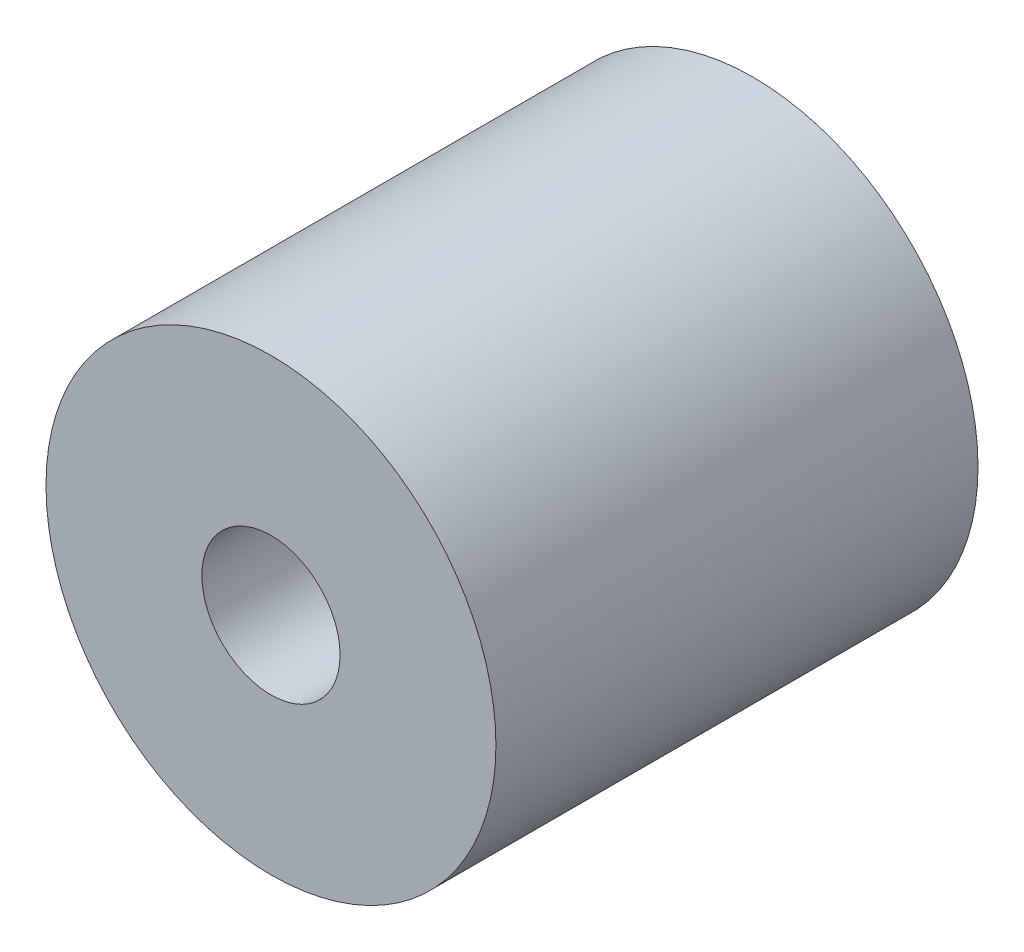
ISO-10303-21;
HEADER;
FILE_DESCRIPTION(('STEP AP214'),'2;1');
FILE_NAME('part.step','',(''),(''),'','','');
FILE_SCHEMA(('AUTOMOTIVE_DESIGN { 1 0 10303 214 1 1 1 1 }'));
ENDSEC;
DATA;
#1=APPLICATION_CONTEXT('core data for automotive mechanical design processes');
#2=APPLICATION_PROTOCOL_DEFINITION('international standard','automotive_design',2000,#1);
#3=PRODUCT_CONTEXT('',#1,'mechanical');
#4=PRODUCT('Part','Part','',(#3));
#5=PRODUCT_RELATED_PRODUCT_CATEGORY('part','',(#4));
#6=PRODUCT_DEFINITION_FORMATION('','',#4);
#7=PRODUCT_DEFINITION_CONTEXT('part definition',#1,'design');
#8=PRODUCT_DEFINITION('design','',#6,#7);
#9=PRODUCT_DEFINITION_SHAPE('','',#8);
#10=(LENGTH_UNIT() NAMED_UNIT(*) SI_UNIT(.MILLI.,.METRE.));
#11=(NAMED_UNIT(*) PLANE_ANGLE_UNIT() SI_UNIT($,.RADIAN.));
#12=(NAMED_UNIT(*) SI_UNIT($,.STERADIAN.) SOLID_ANGLE_UNIT());
#13=UNCERTAINTY_MEASURE_WITH_UNIT(LENGTH_MEASURE(1.E-05),#10,'distance_accuracy_value','');
#14=(GEOMETRIC_REPRESENTATION_CONTEXT(3) GLOBAL_UNCERTAINTY_ASSIGNED_CONTEXT((#13)) GLOBAL_UNIT_ASSIGNED_CONTEXT((#10,
#11,#12)) REPRESENTATION_CONTEXT('',''));
#15=CARTESIAN_POINT('',(0.,0.,0.));
#16=DIRECTION('',(0.,0.,1.));
#17=DIRECTION('',(1.,0.,0.));
#18=AXIS2_PLACEMENT_3D('',#15,#16,#17);
#19=CARTESIAN_POINT('',(76.,143.,30.));
#20=DIRECTION('',(0.,0.,1.));
#21=DIRECTION('',(1.,0.,0.));
#22=AXIS2_PLACEMENT_3D('',#19,#20,#21);
#23=PLANE('',#22);
#24=CARTESIAN_POINT('',(76.,143.,30.));
#25=DIRECTION('',(0.,0.,1.));
#26=DIRECTION('',(1.,0.,0.));
#27=AXIS2_PLACEMENT_3D('',#24,#25,#26);
#28=CIRCLE('',#27,14.);
#29=CARTESIAN_POINT('',(90.,143.,30.));
#30=VERTEX_POINT('',#29);
#31=EDGE_CURVE('E10',#30,#30,#28,.T.);
#32=ORIENTED_EDGE('',*,*,#31,.T.);
#33=EDGE_LOOP('',(#32));
#34=FACE_BOUND('',#33,.T.);
#35=CARTESIAN_POINT('',(76.,143.,30.));
#36=DIRECTION('',(0.,0.,1.));
#37=DIRECTION('',(1.,0.,0.));
#38=AXIS2_PLACEMENT_3D('',#35,#36,#37);
#39=CIRCLE('',#38,4.3);
#40=CARTESIAN_POINT('',(80.3,143.,30.));
#41=VERTEX_POINT('',#40);
#42=EDGE_CURVE('E44',#41,#41,#39,.T.);
#43=ORIENTED_EDGE('',*,*,#42,.F.);
#44=EDGE_LOOP('',(#43));
#45=FACE_BOUND('',#44,.T.);
#46=ADVANCED_FACE('F33',(#34,#45),#23,.T.);
#47=CARTESIAN_POINT('',(76.,143.,0.));
#48=DIRECTION('',(0.,0.,1.));
#49=DIRECTION('',(1.,0.,0.));
#50=AXIS2_PLACEMENT_3D('',#47,#48,#49);
#51=PLANE('',#50);
#52=CARTESIAN_POINT('',(76.,143.,0.));
#53=DIRECTION('',(0.,0.,1.));
#54=DIRECTION('',(1.,0.,0.));
#55=AXIS2_PLACEMENT_3D('',#52,#53,#54);
#56=CIRCLE('',#55,14.);
#57=CARTESIAN_POINT('',(90.,143.,0.));
#58=VERTEX_POINT('',#57);
#59=EDGE_CURVE('E37',#58,#58,#56,.T.);
#60=ORIENTED_EDGE('',*,*,#59,.F.);
#61=EDGE_LOOP('',(#60));
#62=FACE_BOUND('',#61,.T.);
#63=CARTESIAN_POINT('',(76.,143.,0.));
#64=DIRECTION('',(0.,0.,1.));
#65=DIRECTION('',(1.,0.,0.));
#66=AXIS2_PLACEMENT_3D('',#63,#64,#65);
#67=CIRCLE('',#66,4.3);
#68=CARTESIAN_POINT('',(80.3,143.,0.));
#69=VERTEX_POINT('',#68);
#70=EDGE_CURVE('E46',#69,#69,#67,.T.);
#71=ORIENTED_EDGE('',*,*,#70,.T.);
#72=EDGE_LOOP('',(#71));
#73=FACE_BOUND('',#72,.T.);
#74=ADVANCED_FACE('F56',(#62,#73),#51,.F.);
#75=CARTESIAN_POINT('',(76.,143.,30.));
#76=DIRECTION('',(0.,0.,-1.));
#77=DIRECTION('',(-1.,0.,0.));
#78=AXIS2_PLACEMENT_3D('',#75,#76,#77);
#79=CYLINDRICAL_SURFACE('',#78,14.);
#80=ORIENTED_EDGE('',*,*,#31,.F.);
#81=EDGE_LOOP('',(#80));
#82=FACE_BOUND('',#81,.T.);
#83=ORIENTED_EDGE('',*,*,#59,.T.);
#84=EDGE_LOOP('',(#83));
#85=FACE_BOUND('',#84,.T.);
#86=ADVANCED_FACE('F35',(#82,#85),#79,.T.);
#87=CARTESIAN_POINT('',(76.,143.,30.));
#88=DIRECTION('',(0.,0.,-1.));
#89=DIRECTION('',(-1.,0.,0.));
#90=AXIS2_PLACEMENT_3D('',#87,#88,#89);
#91=CYLINDRICAL_SURFACE('',#90,4.3);
#92=ORIENTED_EDGE('',*,*,#42,.T.);
#93=EDGE_LOOP('',(#92));
#94=FACE_BOUND('',#93,.T.);
#95=ORIENTED_EDGE('',*,*,#70,.F.);
#96=EDGE_LOOP('',(#95));
#97=FACE_BOUND('',#96,.T.);
#98=ADVANCED_FACE('F52',(#94,#97),#91,.F.);
#99=CLOSED_SHELL('',(#46,#74,#86,#98));
#100=MANIFOLD_SOLID_BREP('B2',#99);
#101=ADVANCED_BREP_SHAPE_REPRESENTATION('',(#18,#100),#14);
#102=SHAPE_DEFINITION_REPRESENTATION(#9,#101);
ENDSEC;
END-ISO-10303-21;
